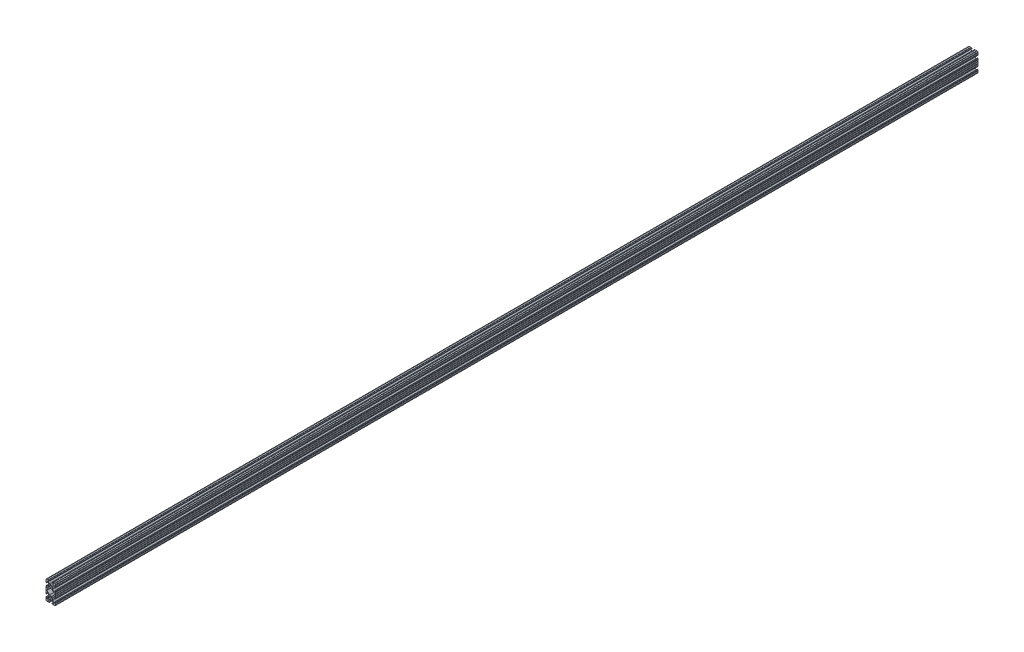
from build123d import *

# Parameters (mm, degrees)
BOSS_EXTRUDE1_DEPTH     = 1219.2
CUT_EXTRUDE1_DEPTH      = 1220.530684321
CUT_EXTRUDE1_DEPTH_BACK = 1220.530684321
SKETCH5_R               = 0.55245
BOSS_EXTRUDE2_DEPTH     = 1219.2
CUT_EXTRUDE2_DEPTH      = 1220.530684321
CUT_EXTRUDE2_DEPTH_BACK = 1220.530684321


with BuildPart() as part:
    # Sketch4 → Boss-Extrude1 (new, symmetric)
    with BuildSketch(Plane.XY):
        with BuildLine():
            Line((4.190365, -25.4), (10.11729625, -25.4))
            ThreePointArc((10.11729625, -25.4), (11.943543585, -24.643543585), (12.7, -22.81729625))
            Line((12.7, -22.81729625), (12.7, -16.890365))
            ThreePointArc((12.7, -16.890365), (12.42492494, -16.22627506), (11.760835, -15.9512))
            Line((11.760835, -15.9512), (11.429365, -15.9512))
            ThreePointArc((11.429365, -15.9512), (10.76527506, -16.22627506), (10.4902, -16.890365))
            Line((10.4902, -16.890365), (10.4902, -19.048478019))
            ThreePointArc((10.4902, -19.048478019), (9.830707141, -20.035478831), (8.666460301, -19.803895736))
            Line((8.666460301, -19.803895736), (5.299899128, -16.437334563))
            ThreePointArc((5.299899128, -16.437334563), (4.817571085, -15.715479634), (4.6482, -14.86399369))
            Line((4.6482, -14.86399369), (4.6482, -12.7))
            Line((4.6482, -12.7), (2.6035, -12.7))
            ThreePointArc((2.6035, -12.7), (1.840952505, -14.540952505), (0, -15.3035))
            Line((0, -15.3035), (0, -17.3482))
            Line((0, -17.3482), (2.16399369, -17.3482))
            ThreePointArc((2.16399369, -17.3482), (3.015479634, -17.517571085), (3.737334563, -17.999899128))
            Line((3.737334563, -17.999899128), (7.103895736, -21.366460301))
            ThreePointArc((7.103895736, -21.366460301), (7.335478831, -22.530707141), (6.348478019, -23.1902))
            Line((6.348478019, -23.1902), (4.190365, -23.1902))
            ThreePointArc((4.190365, -23.1902), (3.52627506, -23.46527506), (3.2512, -24.129365))
            Line((3.2512, -24.129365), (3.2512, -24.460835))
            ThreePointArc((3.2512, -24.460835), (3.52627506, -25.12492494), (4.190365, -25.4))
        make_face()
    extrude(amount=BOSS_EXTRUDE1_DEPTH, both=True)

    # Sketch5 → Cut-Extrude1 (cut, two sides: drawn at the far end of the back side and taken through both)
    with BuildSketch(Plane.XY.offset(-CUT_EXTRUDE1_DEPTH_BACK)):
        with Locations((10.356153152, -25.4)):
            Circle(SKETCH5_R)
        with Locations((5.796028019, -25.4)):
            Circle(SKETCH5_R)
        with Locations((12.7, -23.056153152)):
            Circle(SKETCH5_R)
        with Locations((12.7, -18.496028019)):
            Circle(SKETCH5_R)
    extrude(amount=CUT_EXTRUDE1_DEPTH + CUT_EXTRUDE1_DEPTH_BACK, mode=Mode.SUBTRACT)

    # Mirror1: part across plane


with BuildPart() as part_1:
    add(part.part)
    add(part.part.mirror(Plane(origin=(4.6482, -12.7, 1219.2), x_dir=(0, 0, 1), z_dir=(0, -1, 0))))

    # Sketch6 → Boss-Extrude2 (add, symmetric)
    with BuildSketch(Plane.XY):
        with BuildLine():
            Line((12.7, -1.791396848), (12.7, 0))
            Line((12.7, 0), (9.803703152, 0))
            Line((9.803703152, 0), (9.803703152, -2.343846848))
            Line((9.803703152, -2.343846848), (12.14755, -2.343846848))
            ThreePointArc((12.14755, -2.343846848), (12.309358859, -1.953205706), (12.7, -1.791396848))
        make_face()
    extrude(amount=BOSS_EXTRUDE2_DEPTH, both=True)

    # Sketch7 → Cut-Extrude2 (cut, two sides: drawn at the far end of the back side and taken through both)
    with BuildSketch(Plane.XY.offset(-CUT_EXTRUDE2_DEPTH_BACK)):
        with BuildLine():
            Line((5.420615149, -5.716820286), (10.328391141, -0.809044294))
            ThreePointArc((10.328391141, -0.809044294), (10.448147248, -0.629816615), (10.4902, -0.418403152))
            Line((10.4902, -0.418403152), (10.4902, 0))
            Line((10.4902, 0), (0, 0))
            Line((0, 0), (5.420615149, -5.716820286))
        make_face()
    extrude(amount=CUT_EXTRUDE2_DEPTH + CUT_EXTRUDE2_DEPTH_BACK, mode=Mode.SUBTRACT)

    # Mirror2: part across plane


with BuildPart() as part_2:
    add(part_1.part)
    add(part_1.part.mirror(Plane.ZX))

    # Mirror3: part across plane


with BuildPart() as part_3:
    add(part_2.part)
    add(part_2.part.mirror(Plane(origin=(0, 0, 0), x_dir=(0, 0, 1), z_dir=(1, 0, 0))))


solid = part_3.part
